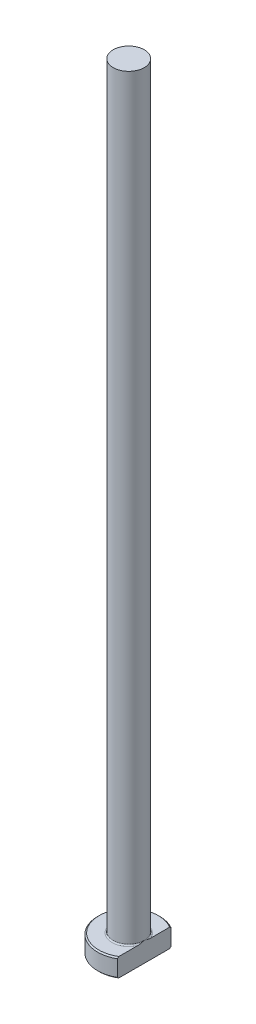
from build123d import *
from build123d.topology import SkipClean

# Parameters (mm, degrees)
CHAMFER1_SIZE = 0.2
FILLET1_R     = 0.2
KEY_DEPTH     = 126.199840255


with BuildPart() as part:
    # Sketch1 → Revolve1 (revolve)
    with BuildSketch(Plane.XY, mode=Mode.PRIVATE) as revolve1_sk:
        Polygon((0, 0), (-5, 0), (-5, 3), (-2.5, 3), (-2.5, 125), (0, 125), align=None)
    revolve(revolve1_sk.sketch.rotate(Axis((0, 259.958771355, 0), (0, -1, 0)), 270), axis=Axis((0, 259.958771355, 0), (0, -1, 0)))

    # Chamfer1
    chamfer1_edges = [part.edges().sort_by_distance(p)[0] for p in [
        (0, 3, -5),
        (0, 0, -5),
    ]]
    chamfer(chamfer1_edges, length=CHAMFER1_SIZE)

    # Fillet1
    fillet1_edges = [part.edges().sort_by_distance(p)[0] for p in [
        (0, 3, -2.5),
    ]]
    fillet(fillet1_edges, radius=FILLET1_R)

    # Sketch2 → KEY (cut, through all)
    with SkipClean():  # the faces are left unmerged after this step: merging them gives an invalid solid
        with BuildSketch(Plane(origin=(0, 0, 0), x_dir=(1, 0, 0), z_dir=(0, 1, 0))):
            with BuildLine():
                Line((2.5, 4.330127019), (2.5, -4.330127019))
                ThreePointArc((2.5, -4.330127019), (5, 0), (2.5, 4.330127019))
            make_face()
        extrude(amount=KEY_DEPTH, mode=Mode.SUBTRACT)


solid = part.part
